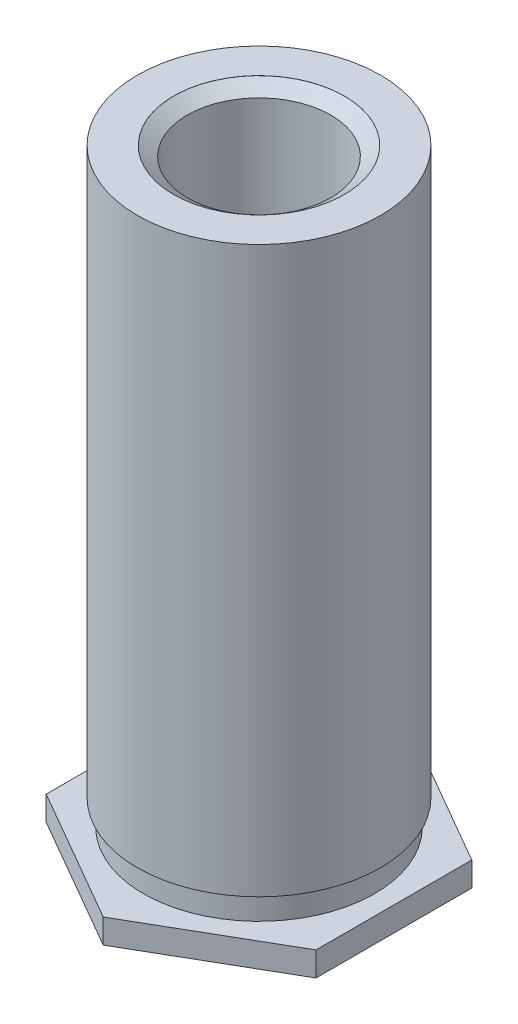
from build123d import *

# Parameters (mm, degrees)
HEXDIESKE_R  = 4.5825
HEXDIE_DEPTH = 0.712


with BuildPart() as part:
    # BodySke → Body (revolve)
    with BuildSketch(Plane.XY, mode=Mode.PRIVATE) as body_sk:
        Polygon((3.56, 0), (4.582, 0), (4.582, 0.712), (3.382, 0.712), (3.382, 1.4596), (3.56, 1.4596), (3.56, 18), (2.1, 18), (2.1, 8.5), (0, 8.5), (0, 0.00254), (3.56, 0.00254), align=None)
    revolve(body_sk.sketch.rotate(Axis((0, 0, 0), (0, 1, 0)), 90), axis=Axis((0, 0, 0), (0, 1, 0)))

    # TapDriSke → TapDrill (revolve, cut)
    with BuildSketch(Plane.XY, mode=Mode.PRIVATE) as tapdrill_sk:
        Polygon((2.1, 4.5), (2.1, 18), (0, 18), (0, 3.630151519), align=None)
    revolve(tapdrill_sk.sketch.rotate(Axis((0, 0, 0), (0, 1, 0)), 90), axis=Axis((0, 0, 0), (0, 1, 0)), mode=Mode.SUBTRACT)

    # EndChamferSke → EndChamfer (revolve, cut)
    with BuildSketch(Plane.XY, mode=Mode.PRIVATE) as endchamfer_sk:
        Polygon((2.5, 17.99746), (2.1, 17.717481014), (2.1, 18.254), (2.5, 18.254), align=None)
    revolve(endchamfer_sk.sketch.rotate(Axis((0, -2.54, 0), (0, 1, 0)), 90), axis=Axis((0, -2.54, 0), (0, 1, 0)), mode=Mode.SUBTRACT)

    # HexDieSke → HexDie (cut)
    with BuildSketch(Plane(origin=(0, 0.712, 0), x_dir=(-1, 0, 0), z_dir=(0, 1, 0))):
        Circle(HEXDIESKE_R)
        Polygon((0, 4.561067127), (3.95, 2.280533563), (3.95, -2.280533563), (0, -4.561067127), (-3.95, -2.280533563), (-3.95, 2.280533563), align=None, mode=Mode.SUBTRACT)
    extrude(amount=-HEXDIE_DEPTH, mode=Mode.SUBTRACT)


solid = part.part
